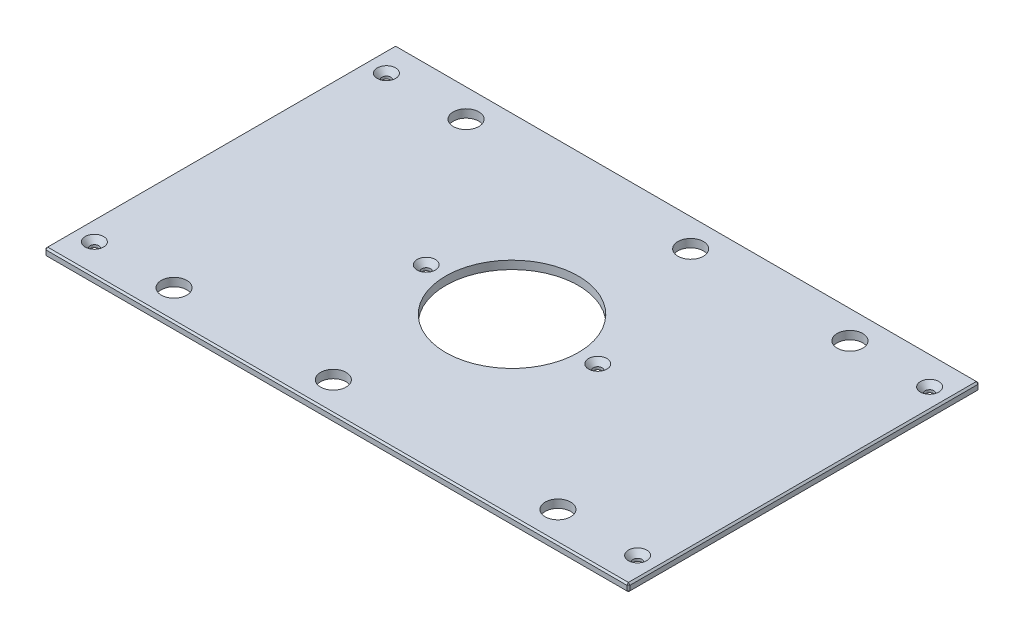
from build123d import *

# Parameters (mm, degrees)
SKETCH1_W                                     = 454.025
SKETCH1_H                                     = 273.05
BOSS_EXTRUDE1_DEPTH                           = 6.35
SKETCH13_R                                    = 51.562
CUT_EXTRUDE6_DEPTH                            = 265.979382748
F_25_32_0_78125_DIAMETER_HOLE1_D              = 19.84375
CHAMFER2_SIZE                                 = 1.27
CSK_FOR_1_4_FLAT_HEAD_MACHINE_SCREW1_AT_COUNT = 2
CSK_FOR_1_4_FLAT_HEAD_MACHINE_SCREW1_AT_PITCH = 227.00996
CSK_FOR_1_4_FLAT_HEAD_MACHINE_SCREW1_2_COUNT  = 2
CSK_FOR_1_4_FLAT_HEAD_MACHINE_SCREW1_2_PITCH  = 479.426425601
CSK_FOR_1_4_FLAT_HEAD_MACHINE_SCREW1_3_COUNT  = 2
CSK_FOR_1_4_FLAT_HEAD_MACHINE_SCREW1_3_PITCH  = 300.105257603
CSK_FOR_1_4_FLAT_HEAD_MACHINE_SCREW1_4_COUNT  = 2
CSK_FOR_1_4_FLAT_HEAD_MACHINE_SCREW1_4_PITCH  = 183.71933592
CSK_FOR_1_4_FLAT_HEAD_MACHINE_SCREW1_5_COUNT  = 2
CSK_FOR_1_4_FLAT_HEAD_MACHINE_SCREW1_5_PITCH  = 422.275
CSK_FOR_1_4_FLAT_HEAD_MACHINE_SCREW1_6_COUNT  = 2
CSK_FOR_1_4_FLAT_HEAD_MACHINE_SCREW1_6_PITCH  = 360.3625
CSK_FOR_1_4_FLAT_HEAD_MACHINE_SCREW1_7_COUNT  = 2
CSK_FOR_1_4_FLAT_HEAD_MACHINE_SCREW1_7_PITCH  = 425.904512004


with BuildPart() as part:
    # Sketch1 → Boss-Extrude1 (new body)
    with BuildSketch(Plane(origin=(0, 0, 0), x_dir=(1, 0, 0), z_dir=(0, 1, 0))):
        Rectangle(SKETCH1_W, SKETCH1_H)
    extrude(amount=BOSS_EXTRUDE1_DEPTH)

    # Sketch13 → Cut-Extrude6 (cut, through all)
    with BuildSketch(Plane(origin=(0, 6.35, 0), x_dir=(1, 0, 0), z_dir=(0, 1, 0))):
        with Locations(Location((0, 0, 0), (0, 0, 270))):
            Circle(SKETCH13_R)
    extrude(amount=-CUT_EXTRUDE6_DEPTH, mode=Mode.SUBTRACT)

    # 25_32 _0.78125_ Diameter Hole1 (through all)
    with Locations(Plane(origin=(0, 6.35, 0), x_dir=(1, 0, 0), z_dir=(0, 1, 0))):
        with Locations((149.225, 113.50498), (-149.225, 113.50498), (149.225, -113.50498), (-149.225, -113.50498), (25.4, 113.50498), (-25.4, -113.50498)):
            Hole(F_25_32_0_78125_DIAMETER_HOLE1_D / 2)

    # Chamfer2
    chamfer2_edges = [part.edges().sort_by_distance(p)[0] for p in [
        (227.0125, 6.35, 0),
        (0, 6.35, -136.525),
        (-227.0125, 6.35, 0),
        (0, 0, -136.525),
        (227.0125, 0, 0),
        (0, 0, 136.525),
        (-227.0125, 0, 0),
        (0, 6.35, 136.525),
        (-227.0125, 3.175, -136.525),
        (227.0125, 3.175, -136.525),
        (227.0125, 3.175, 136.525),
        (-227.0125, 3.175, 136.525),
    ]]
    chamfer(chamfer2_edges, length=CHAMFER2_SIZE)

    # Sketch24 → CSK for 1_4 Flat Head Machine Screw1 (revolve, cut)
    with BuildSketch(Plane(origin=(211.1375, 6.35, -113.50498), x_dir=(0, 0, 1), z_dir=(1, 0, 0))):
        Polygon((0, 0), (0, 6.35), (3.3782, 6.35), (3.3782, 4.324464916), (7.1374, 0), align=None)
    csk_for_1_4_flat_head_machine_screw1 = revolve(axis=Axis((211.1375, 12.7, -113.50498), (0, -1, 0)), mode=Mode.SUBTRACT)

    # CSK for 1_4 Flat Head Machine Screw1 at: CSK for 1_4 Flat Head Machine Screw1 ×2
    with Locations(*[(0, 0, i * CSK_FOR_1_4_FLAT_HEAD_MACHINE_SCREW1_AT_PITCH) for i in range(1, CSK_FOR_1_4_FLAT_HEAD_MACHINE_SCREW1_AT_COUNT)]):
        add(csk_for_1_4_flat_head_machine_screw1, mode=Mode.SUBTRACT)

    # CSK for 1_4 Flat Head Machine Screw1 2: CSK for 1_4 Flat Head Machine Screw1 ×2
    with Locations(*[Vector(-0.88079208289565, 0, 0.47350322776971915) * (i * CSK_FOR_1_4_FLAT_HEAD_MACHINE_SCREW1_2_PITCH) for i in range(1, CSK_FOR_1_4_FLAT_HEAD_MACHINE_SCREW1_2_COUNT)]):
        add(csk_for_1_4_flat_head_machine_screw1, mode=Mode.SUBTRACT)

    # CSK for 1_4 Flat Head Machine Screw1 3: CSK for 1_4 Flat Head Machine Screw1 ×2
    with Locations(*[Vector(-0.9257168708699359, 0, 0.37821723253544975) * (i * CSK_FOR_1_4_FLAT_HEAD_MACHINE_SCREW1_3_PITCH) for i in range(1, CSK_FOR_1_4_FLAT_HEAD_MACHINE_SCREW1_3_COUNT)]):
        add(csk_for_1_4_flat_head_machine_screw1, mode=Mode.SUBTRACT)

    # CSK for 1_4 Flat Head Machine Screw1 4: CSK for 1_4 Flat Head Machine Screw1 ×2
    with Locations(*[Vector(-0.7863216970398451, 0, 0.617817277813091) * (i * CSK_FOR_1_4_FLAT_HEAD_MACHINE_SCREW1_4_PITCH) for i in range(1, CSK_FOR_1_4_FLAT_HEAD_MACHINE_SCREW1_4_COUNT)]):
        add(csk_for_1_4_flat_head_machine_screw1, mode=Mode.SUBTRACT)

    # CSK for 1_4 Flat Head Machine Screw1 5: CSK for 1_4 Flat Head Machine Screw1 ×2
    with Locations(*[(-i * CSK_FOR_1_4_FLAT_HEAD_MACHINE_SCREW1_5_PITCH, 0, 0) for i in range(1, CSK_FOR_1_4_FLAT_HEAD_MACHINE_SCREW1_5_COUNT)]):
        add(csk_for_1_4_flat_head_machine_screw1, mode=Mode.SUBTRACT)

    # CSK for 1_4 Flat Head Machine Screw1 6: CSK for 1_4 Flat Head Machine Screw1 ×2
    with Locations(*[(-i * CSK_FOR_1_4_FLAT_HEAD_MACHINE_SCREW1_6_PITCH, 0, 0) for i in range(1, CSK_FOR_1_4_FLAT_HEAD_MACHINE_SCREW1_6_COUNT)]):
        add(csk_for_1_4_flat_head_machine_screw1, mode=Mode.SUBTRACT)

    # CSK for 1_4 Flat Head Machine Screw1 7: CSK for 1_4 Flat Head Machine Screw1 ×2
    with Locations(*[Vector(-0.8461110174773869, 0, 0.5330067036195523) * (i * CSK_FOR_1_4_FLAT_HEAD_MACHINE_SCREW1_7_PITCH) for i in range(1, CSK_FOR_1_4_FLAT_HEAD_MACHINE_SCREW1_7_COUNT)]):
        add(csk_for_1_4_flat_head_machine_screw1, mode=Mode.SUBTRACT)


solid = part.part
